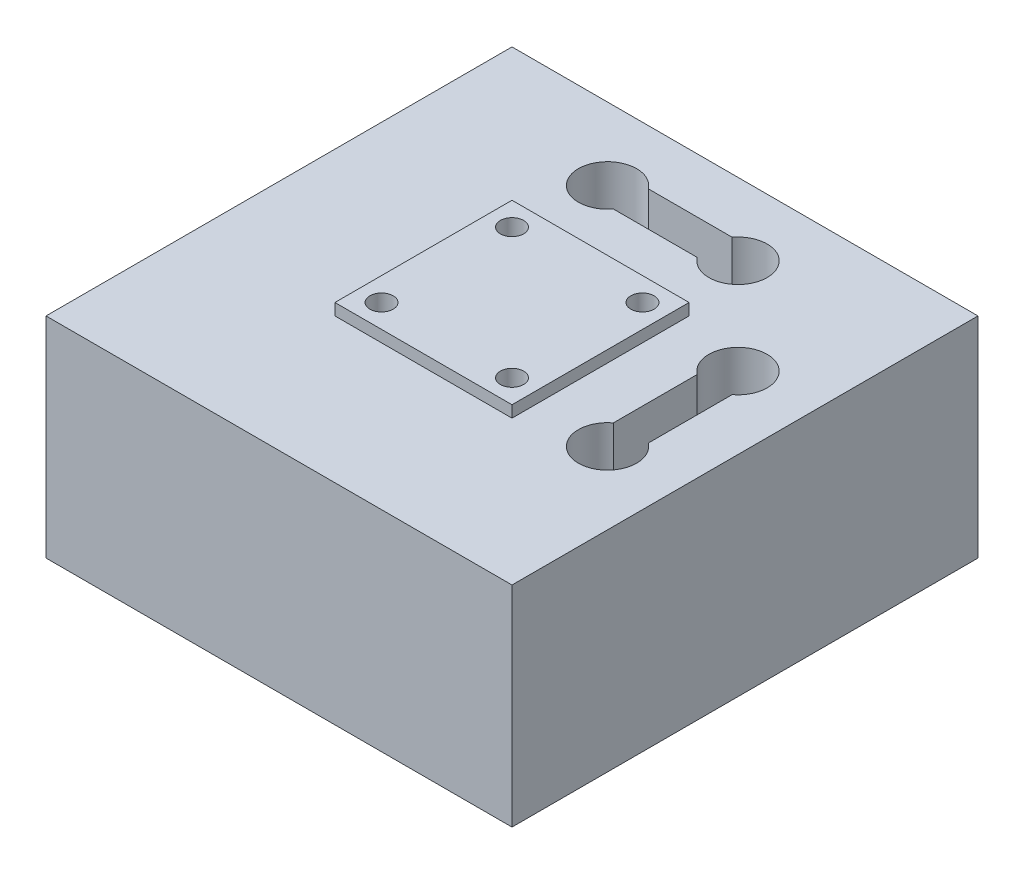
ISO-10303-21;
HEADER;
FILE_DESCRIPTION(('STEP AP214'),'2;1');
FILE_NAME('part.step','',(''),(''),'','','');
FILE_SCHEMA(('AUTOMOTIVE_DESIGN { 1 0 10303 214 1 1 1 1 }'));
ENDSEC;
DATA;
#1=APPLICATION_CONTEXT('core data for automotive mechanical design processes');
#2=APPLICATION_PROTOCOL_DEFINITION('international standard','automotive_design',2000,#1);
#3=PRODUCT_CONTEXT('',#1,'mechanical');
#4=PRODUCT('Part','Part','',(#3));
#5=PRODUCT_RELATED_PRODUCT_CATEGORY('part','',(#4));
#6=PRODUCT_DEFINITION_FORMATION('','',#4);
#7=PRODUCT_DEFINITION_CONTEXT('part definition',#1,'design');
#8=PRODUCT_DEFINITION('design','',#6,#7);
#9=PRODUCT_DEFINITION_SHAPE('','',#8);
#10=(LENGTH_UNIT() NAMED_UNIT(*) SI_UNIT(.MILLI.,.METRE.));
#11=(NAMED_UNIT(*) PLANE_ANGLE_UNIT() SI_UNIT($,.RADIAN.));
#12=(NAMED_UNIT(*) SI_UNIT($,.STERADIAN.) SOLID_ANGLE_UNIT());
#13=UNCERTAINTY_MEASURE_WITH_UNIT(LENGTH_MEASURE(1.E-05),#10,'distance_accuracy_value','');
#14=(GEOMETRIC_REPRESENTATION_CONTEXT(3) GLOBAL_UNCERTAINTY_ASSIGNED_CONTEXT((#13)) GLOBAL_UNIT_ASSIGNED_CONTEXT((#10,
#11,#12)) REPRESENTATION_CONTEXT('',''));
#15=CARTESIAN_POINT('',(0.,0.,0.));
#16=DIRECTION('',(0.,0.,1.));
#17=DIRECTION('',(1.,0.,0.));
#18=AXIS2_PLACEMENT_3D('',#15,#16,#17);
#19=CARTESIAN_POINT('',(0.,18.,0.));
#20=DIRECTION('',(1.,0.,0.));
#21=DIRECTION('',(0.,0.,-1.));
#22=AXIS2_PLACEMENT_3D('',#19,#20,#21);
#23=PLANE('',#22);
#24=DIRECTION('',(0.,0.,1.));
#25=VECTOR('',#24,1.);
#26=CARTESIAN_POINT('',(0.,0.,0.));
#27=LINE('',#26,#25);
#28=CARTESIAN_POINT('',(0.,0.,-40.));
#29=VERTEX_POINT('',#28);
#30=CARTESIAN_POINT('',(0.,0.,0.));
#31=VERTEX_POINT('',#30);
#32=EDGE_CURVE('E381',#29,#31,#27,.T.);
#33=ORIENTED_EDGE('',*,*,#32,.T.);
#34=DIRECTION('',(0.,-1.,0.));
#35=VECTOR('',#34,1.);
#36=CARTESIAN_POINT('',(0.,18.,0.));
#37=LINE('',#36,#35);
#38=CARTESIAN_POINT('',(0.,18.,0.));
#39=VERTEX_POINT('',#38);
#40=EDGE_CURVE('E419',#39,#31,#37,.T.);
#41=ORIENTED_EDGE('',*,*,#40,.F.);
#42=DIRECTION('',(0.,0.,1.));
#43=VECTOR('',#42,1.);
#44=CARTESIAN_POINT('',(0.,18.,0.));
#45=LINE('',#44,#43);
#46=CARTESIAN_POINT('',(0.,18.,-40.));
#47=VERTEX_POINT('',#46);
#48=EDGE_CURVE('E382',#47,#39,#45,.T.);
#49=ORIENTED_EDGE('',*,*,#48,.F.);
#50=DIRECTION('',(0.,-1.,0.));
#51=VECTOR('',#50,1.);
#52=CARTESIAN_POINT('',(0.,18.,-40.));
#53=LINE('',#52,#51);
#54=EDGE_CURVE('E396',#47,#29,#53,.T.);
#55=ORIENTED_EDGE('',*,*,#54,.T.);
#56=EDGE_LOOP('',(#33,#41,#49,#55));
#57=FACE_BOUND('',#56,.T.);
#58=ADVANCED_FACE('F45',(#57),#23,.F.);
#59=CARTESIAN_POINT('',(0.,18.,0.));
#60=DIRECTION('',(0.,0.,-1.));
#61=DIRECTION('',(-1.,0.,0.));
#62=AXIS2_PLACEMENT_3D('',#59,#60,#61);
#63=PLANE('',#62);
#64=DIRECTION('',(1.,0.,0.));
#65=VECTOR('',#64,1.);
#66=CARTESIAN_POINT('',(0.,0.,0.));
#67=LINE('',#66,#65);
#68=CARTESIAN_POINT('',(40.,0.,0.));
#69=VERTEX_POINT('',#68);
#70=EDGE_CURVE('E400',#31,#69,#67,.T.);
#71=ORIENTED_EDGE('',*,*,#70,.T.);
#72=DIRECTION('',(0.,-1.,0.));
#73=VECTOR('',#72,1.);
#74=CARTESIAN_POINT('',(40.,18.,0.));
#75=LINE('',#74,#73);
#76=CARTESIAN_POINT('',(40.,18.,0.));
#77=VERTEX_POINT('',#76);
#78=EDGE_CURVE('E415',#77,#69,#75,.T.);
#79=ORIENTED_EDGE('',*,*,#78,.F.);
#80=DIRECTION('',(1.,0.,0.));
#81=VECTOR('',#80,1.);
#82=CARTESIAN_POINT('',(0.,18.,0.));
#83=LINE('',#82,#81);
#84=EDGE_CURVE('E386',#39,#77,#83,.T.);
#85=ORIENTED_EDGE('',*,*,#84,.F.);
#86=ORIENTED_EDGE('',*,*,#40,.T.);
#87=EDGE_LOOP('',(#71,#79,#85,#86));
#88=FACE_BOUND('',#87,.T.);
#89=ADVANCED_FACE('F460',(#88),#63,.F.);
#90=CARTESIAN_POINT('',(40.,18.,0.));
#91=DIRECTION('',(-1.,0.,0.));
#92=DIRECTION('',(0.,0.,1.));
#93=AXIS2_PLACEMENT_3D('',#90,#91,#92);
#94=PLANE('',#93);
#95=DIRECTION('',(0.,0.,-1.));
#96=VECTOR('',#95,1.);
#97=CARTESIAN_POINT('',(40.,0.,0.));
#98=LINE('',#97,#96);
#99=CARTESIAN_POINT('',(40.,0.,-40.));
#100=VERTEX_POINT('',#99);
#101=EDGE_CURVE('E403',#69,#100,#98,.T.);
#102=ORIENTED_EDGE('',*,*,#101,.T.);
#103=DIRECTION('',(0.,-1.,0.));
#104=VECTOR('',#103,1.);
#105=CARTESIAN_POINT('',(40.,18.,-40.));
#106=LINE('',#105,#104);
#107=CARTESIAN_POINT('',(40.,18.,-40.));
#108=VERTEX_POINT('',#107);
#109=EDGE_CURVE('E411',#108,#100,#106,.T.);
#110=ORIENTED_EDGE('',*,*,#109,.F.);
#111=DIRECTION('',(0.,0.,-1.));
#112=VECTOR('',#111,1.);
#113=CARTESIAN_POINT('',(40.,18.,0.));
#114=LINE('',#113,#112);
#115=EDGE_CURVE('E390',#77,#108,#114,.T.);
#116=ORIENTED_EDGE('',*,*,#115,.F.);
#117=ORIENTED_EDGE('',*,*,#78,.T.);
#118=EDGE_LOOP('',(#102,#110,#116,#117));
#119=FACE_BOUND('',#118,.T.);
#120=ADVANCED_FACE('F465',(#119),#94,.F.);
#121=CARTESIAN_POINT('',(0.,18.,-40.));
#122=DIRECTION('',(0.,0.,1.));
#123=DIRECTION('',(1.,0.,0.));
#124=AXIS2_PLACEMENT_3D('',#121,#122,#123);
#125=PLANE('',#124);
#126=DIRECTION('',(-1.,0.,0.));
#127=VECTOR('',#126,1.);
#128=CARTESIAN_POINT('',(0.,0.,-40.));
#129=LINE('',#128,#127);
#130=EDGE_CURVE('E387',#100,#29,#129,.T.);
#131=ORIENTED_EDGE('',*,*,#130,.T.);
#132=ORIENTED_EDGE('',*,*,#54,.F.);
#133=DIRECTION('',(-1.,0.,0.));
#134=VECTOR('',#133,1.);
#135=CARTESIAN_POINT('',(0.,18.,-40.));
#136=LINE('',#135,#134);
#137=EDGE_CURVE('E393',#108,#47,#136,.T.);
#138=ORIENTED_EDGE('',*,*,#137,.F.);
#139=ORIENTED_EDGE('',*,*,#109,.T.);
#140=EDGE_LOOP('',(#131,#132,#138,#139));
#141=FACE_BOUND('',#140,.T.);
#142=ADVANCED_FACE('F448',(#141),#125,.F.);
#143=CARTESIAN_POINT('',(0.,18.,0.));
#144=DIRECTION('',(0.,-1.,0.));
#145=DIRECTION('',(0.,0.,-1.));
#146=AXIS2_PLACEMENT_3D('',#143,#144,#145);
#147=PLANE('',#146);
#148=DIRECTION('',(-1.,0.,0.));
#149=VECTOR('',#148,1.);
#150=CARTESIAN_POINT('',(0.,18.,-32.3));
#151=LINE('',#150,#149);
#152=CARTESIAN_POINT('',(23.6,18.,-32.3));
#153=VERTEX_POINT('',#152);
#154=CARTESIAN_POINT('',(16.4,18.,-32.3));
#155=VERTEX_POINT('',#154);
#156=EDGE_CURVE('E300',#153,#155,#151,.T.);
#157=ORIENTED_EDGE('',*,*,#156,.T.);
#158=CARTESIAN_POINT('',(14.4,18.,-33.8));
#159=DIRECTION('',(0.,-1.,0.));
#160=DIRECTION('',(0.,0.,-1.));
#161=AXIS2_PLACEMENT_3D('',#158,#159,#160);
#162=CIRCLE('',#161,2.5);
#163=CARTESIAN_POINT('',(16.4,18.,-35.3));
#164=VERTEX_POINT('',#163);
#165=EDGE_CURVE('E309',#155,#164,#162,.T.);
#166=ORIENTED_EDGE('',*,*,#165,.T.);
#167=DIRECTION('',(-1.,0.,0.));
#168=VECTOR('',#167,1.);
#169=CARTESIAN_POINT('',(0.,18.,-35.3));
#170=LINE('',#169,#168);
#171=CARTESIAN_POINT('',(23.6,18.,-35.3));
#172=VERTEX_POINT('',#171);
#173=EDGE_CURVE('E306',#172,#164,#170,.T.);
#174=ORIENTED_EDGE('',*,*,#173,.F.);
#175=CARTESIAN_POINT('',(25.6,18.,-33.8));
#176=DIRECTION('',(0.,-1.,0.));
#177=DIRECTION('',(0.,0.,-1.));
#178=AXIS2_PLACEMENT_3D('',#175,#176,#177);
#179=CIRCLE('',#178,2.5);
#180=EDGE_CURVE('E236',#172,#153,#179,.T.);
#181=ORIENTED_EDGE('',*,*,#180,.T.);
#182=EDGE_LOOP('',(#157,#166,#174,#181));
#183=FACE_BOUND('',#182,.T.);
#184=DIRECTION('',(0.,0.,-1.));
#185=VECTOR('',#184,1.);
#186=CARTESIAN_POINT('',(32.3,18.,0.));
#187=LINE('',#186,#185);
#188=CARTESIAN_POINT('',(32.3,18.,-16.4));
#189=VERTEX_POINT('',#188);
#190=CARTESIAN_POINT('',(32.3,18.,-23.6));
#191=VERTEX_POINT('',#190);
#192=EDGE_CURVE('E242',#189,#191,#187,.T.);
#193=ORIENTED_EDGE('',*,*,#192,.T.);
#194=CARTESIAN_POINT('',(33.8,18.,-25.6));
#195=DIRECTION('',(0.,-1.,0.));
#196=DIRECTION('',(0.,0.,-1.));
#197=AXIS2_PLACEMENT_3D('',#194,#195,#196);
#198=CIRCLE('',#197,2.5);
#199=CARTESIAN_POINT('',(35.3,18.,-23.6));
#200=VERTEX_POINT('',#199);
#201=EDGE_CURVE('E197',#191,#200,#198,.T.);
#202=ORIENTED_EDGE('',*,*,#201,.T.);
#203=DIRECTION('',(0.,0.,-1.));
#204=VECTOR('',#203,1.);
#205=CARTESIAN_POINT('',(35.3,18.,0.));
#206=LINE('',#205,#204);
#207=CARTESIAN_POINT('',(35.3,18.,-16.4));
#208=VERTEX_POINT('',#207);
#209=EDGE_CURVE('E295',#208,#200,#206,.T.);
#210=ORIENTED_EDGE('',*,*,#209,.F.);
#211=CARTESIAN_POINT('',(33.8,18.,-14.4));
#212=DIRECTION('',(0.,-1.,0.));
#213=DIRECTION('',(0.,0.,-1.));
#214=AXIS2_PLACEMENT_3D('',#211,#212,#213);
#215=CIRCLE('',#214,2.5);
#216=EDGE_CURVE('E291',#208,#189,#215,.T.);
#217=ORIENTED_EDGE('',*,*,#216,.T.);
#218=EDGE_LOOP('',(#193,#202,#210,#217));
#219=FACE_BOUND('',#218,.T.);
#220=DIRECTION('',(-1.,0.,0.));
#221=VECTOR('',#220,1.);
#222=CARTESIAN_POINT('',(0.,18.,-12.4));
#223=LINE('',#222,#221);
#224=CARTESIAN_POINT('',(27.6,18.,-12.4));
#225=VERTEX_POINT('',#224);
#226=CARTESIAN_POINT('',(12.4,18.,-12.4));
#227=VERTEX_POINT('',#226);
#228=EDGE_CURVE('E350',#225,#227,#223,.T.);
#229=ORIENTED_EDGE('',*,*,#228,.T.);
#230=DIRECTION('',(0.,0.,-1.));
#231=VECTOR('',#230,1.);
#232=CARTESIAN_POINT('',(12.4,18.,0.));
#233=LINE('',#232,#231);
#234=CARTESIAN_POINT('',(12.4,18.,-27.6));
#235=VERTEX_POINT('',#234);
#236=EDGE_CURVE('E377',#227,#235,#233,.T.);
#237=ORIENTED_EDGE('',*,*,#236,.T.);
#238=DIRECTION('',(1.,0.,0.));
#239=VECTOR('',#238,1.);
#240=CARTESIAN_POINT('',(0.,18.,-27.6));
#241=LINE('',#240,#239);
#242=CARTESIAN_POINT('',(27.6,18.,-27.6));
#243=VERTEX_POINT('',#242);
#244=EDGE_CURVE('E373',#235,#243,#241,.T.);
#245=ORIENTED_EDGE('',*,*,#244,.T.);
#246=DIRECTION('',(0.,0.,1.));
#247=VECTOR('',#246,1.);
#248=CARTESIAN_POINT('',(27.6,18.,0.));
#249=LINE('',#248,#247);
#250=EDGE_CURVE('E369',#243,#225,#249,.T.);
#251=ORIENTED_EDGE('',*,*,#250,.T.);
#252=EDGE_LOOP('',(#229,#237,#245,#251));
#253=FACE_BOUND('',#252,.T.);
#254=ORIENTED_EDGE('',*,*,#48,.T.);
#255=ORIENTED_EDGE('',*,*,#84,.T.);
#256=ORIENTED_EDGE('',*,*,#115,.T.);
#257=ORIENTED_EDGE('',*,*,#137,.T.);
#258=EDGE_LOOP('',(#254,#255,#256,#257));
#259=FACE_BOUND('',#258,.T.);
#260=ADVANCED_FACE('F445',(#183,#219,#253,#259),#147,.F.);
#261=CARTESIAN_POINT('',(0.,0.,0.));
#262=DIRECTION('',(0.,-1.,0.));
#263=DIRECTION('',(0.,0.,-1.));
#264=AXIS2_PLACEMENT_3D('',#261,#262,#263);
#265=PLANE('',#264);
#266=CARTESIAN_POINT('',(14.4,0.,-33.8));
#267=DIRECTION('',(0.,-1.,0.));
#268=DIRECTION('',(0.,0.,-1.));
#269=AXIS2_PLACEMENT_3D('',#266,#267,#268);
#270=CIRCLE('',#269,2.5);
#271=CARTESIAN_POINT('',(16.4,0.,-32.3));
#272=VERTEX_POINT('',#271);
#273=CARTESIAN_POINT('',(16.4,0.,-35.3));
#274=VERTEX_POINT('',#273);
#275=EDGE_CURVE('E11',#272,#274,#270,.T.);
#276=ORIENTED_EDGE('',*,*,#275,.F.);
#277=DIRECTION('',(-1.,0.,0.));
#278=VECTOR('',#277,1.);
#279=CARTESIAN_POINT('',(0.,0.,-32.3));
#280=LINE('',#279,#278);
#281=CARTESIAN_POINT('',(23.6,0.,-32.3));
#282=VERTEX_POINT('',#281);
#283=EDGE_CURVE('E206',#282,#272,#280,.T.);
#284=ORIENTED_EDGE('',*,*,#283,.F.);
#285=CARTESIAN_POINT('',(25.6,0.,-33.8));
#286=DIRECTION('',(0.,-1.,0.));
#287=DIRECTION('',(0.,0.,-1.));
#288=AXIS2_PLACEMENT_3D('',#285,#286,#287);
#289=CIRCLE('',#288,2.5);
#290=CARTESIAN_POINT('',(23.6,0.,-35.3));
#291=VERTEX_POINT('',#290);
#292=EDGE_CURVE('E210',#291,#282,#289,.T.);
#293=ORIENTED_EDGE('',*,*,#292,.F.);
#294=DIRECTION('',(-1.,0.,0.));
#295=VECTOR('',#294,1.);
#296=CARTESIAN_POINT('',(0.,0.,-35.3));
#297=LINE('',#296,#295);
#298=EDGE_CURVE('E53',#291,#274,#297,.T.);
#299=ORIENTED_EDGE('',*,*,#298,.T.);
#300=EDGE_LOOP('',(#276,#284,#293,#299));
#301=FACE_BOUND('',#300,.T.);
#302=CARTESIAN_POINT('',(33.8,0.,-25.6));
#303=DIRECTION('',(0.,-1.,0.));
#304=DIRECTION('',(0.,0.,-1.));
#305=AXIS2_PLACEMENT_3D('',#302,#303,#304);
#306=CIRCLE('',#305,2.5);
#307=CARTESIAN_POINT('',(32.3,0.,-23.6));
#308=VERTEX_POINT('',#307);
#309=CARTESIAN_POINT('',(35.3,0.,-23.6));
#310=VERTEX_POINT('',#309);
#311=EDGE_CURVE('E194',#308,#310,#306,.T.);
#312=ORIENTED_EDGE('',*,*,#311,.F.);
#313=DIRECTION('',(0.,0.,-1.));
#314=VECTOR('',#313,1.);
#315=CARTESIAN_POINT('',(32.3,0.,0.));
#316=LINE('',#315,#314);
#317=CARTESIAN_POINT('',(32.3,0.,-16.4));
#318=VERTEX_POINT('',#317);
#319=EDGE_CURVE('E179',#318,#308,#316,.T.);
#320=ORIENTED_EDGE('',*,*,#319,.F.);
#321=CARTESIAN_POINT('',(33.8,0.,-14.4));
#322=DIRECTION('',(0.,-1.,0.));
#323=DIRECTION('',(0.,0.,-1.));
#324=AXIS2_PLACEMENT_3D('',#321,#322,#323);
#325=CIRCLE('',#324,2.5);
#326=CARTESIAN_POINT('',(35.3,0.,-16.4));
#327=VERTEX_POINT('',#326);
#328=EDGE_CURVE('E188',#327,#318,#325,.T.);
#329=ORIENTED_EDGE('',*,*,#328,.F.);
#330=DIRECTION('',(0.,0.,-1.));
#331=VECTOR('',#330,1.);
#332=CARTESIAN_POINT('',(35.3,0.,0.));
#333=LINE('',#332,#331);
#334=EDGE_CURVE('E204',#327,#310,#333,.T.);
#335=ORIENTED_EDGE('',*,*,#334,.T.);
#336=EDGE_LOOP('',(#312,#320,#329,#335));
#337=FACE_BOUND('',#336,.T.);
#338=DIRECTION('',(0.,0.,-1.));
#339=VECTOR('',#338,1.);
#340=CARTESIAN_POINT('',(12.4,0.,0.));
#341=LINE('',#340,#339);
#342=CARTESIAN_POINT('',(12.4,0.,-12.4));
#343=VERTEX_POINT('',#342);
#344=CARTESIAN_POINT('',(12.4,0.,-27.6));
#345=VERTEX_POINT('',#344);
#346=EDGE_CURVE('E189',#343,#345,#341,.T.);
#347=ORIENTED_EDGE('',*,*,#346,.F.);
#348=DIRECTION('',(-1.,0.,0.));
#349=VECTOR('',#348,1.);
#350=CARTESIAN_POINT('',(0.,0.,-12.4));
#351=LINE('',#350,#349);
#352=CARTESIAN_POINT('',(27.6,0.,-12.4));
#353=VERTEX_POINT('',#352);
#354=EDGE_CURVE('E423',#353,#343,#351,.T.);
#355=ORIENTED_EDGE('',*,*,#354,.F.);
#356=DIRECTION('',(0.,0.,1.));
#357=VECTOR('',#356,1.);
#358=CARTESIAN_POINT('',(27.6,0.,0.));
#359=LINE('',#358,#357);
#360=CARTESIAN_POINT('',(27.6,0.,-27.6));
#361=VERTEX_POINT('',#360);
#362=EDGE_CURVE('E427',#361,#353,#359,.T.);
#363=ORIENTED_EDGE('',*,*,#362,.F.);
#364=DIRECTION('',(1.,0.,0.));
#365=VECTOR('',#364,1.);
#366=CARTESIAN_POINT('',(0.,0.,-27.6));
#367=LINE('',#366,#365);
#368=EDGE_CURVE('E431',#345,#361,#367,.T.);
#369=ORIENTED_EDGE('',*,*,#368,.F.);
#370=EDGE_LOOP('',(#347,#355,#363,#369));
#371=FACE_BOUND('',#370,.T.);
#372=ORIENTED_EDGE('',*,*,#32,.F.);
#373=ORIENTED_EDGE('',*,*,#130,.F.);
#374=ORIENTED_EDGE('',*,*,#101,.F.);
#375=ORIENTED_EDGE('',*,*,#70,.F.);
#376=EDGE_LOOP('',(#372,#373,#374,#375));
#377=FACE_BOUND('',#376,.T.);
#378=ADVANCED_FACE('F202',(#301,#337,#371,#377),#265,.T.);
#379=CARTESIAN_POINT('',(0.,-1.,0.));
#380=DIRECTION('',(0.,-1.,0.));
#381=DIRECTION('',(0.,0.,-1.));
#382=AXIS2_PLACEMENT_3D('',#379,#380,#381);
#383=PLANE('',#382);
#384=CARTESIAN_POINT('',(14.4,-1.,-14.4));
#385=DIRECTION('',(0.,1.,0.));
#386=DIRECTION('',(0.,0.,1.));
#387=AXIS2_PLACEMENT_3D('',#384,#385,#386);
#388=CIRCLE('',#387,1.);
#389=CARTESIAN_POINT('',(14.4,-1.,-13.4));
#390=VERTEX_POINT('',#389);
#391=EDGE_CURVE('E253',#390,#390,#388,.T.);
#392=ORIENTED_EDGE('',*,*,#391,.T.);
#393=EDGE_LOOP('',(#392));
#394=FACE_BOUND('',#393,.T.);
#395=CARTESIAN_POINT('',(25.6,-1.,-14.4));
#396=DIRECTION('',(0.,1.,0.));
#397=DIRECTION('',(0.,0.,1.));
#398=AXIS2_PLACEMENT_3D('',#395,#396,#397);
#399=CIRCLE('',#398,1.);
#400=CARTESIAN_POINT('',(25.6,-1.,-13.4));
#401=VERTEX_POINT('',#400);
#402=EDGE_CURVE('E261',#401,#401,#399,.T.);
#403=ORIENTED_EDGE('',*,*,#402,.T.);
#404=EDGE_LOOP('',(#403));
#405=FACE_BOUND('',#404,.T.);
#406=CARTESIAN_POINT('',(25.6,-1.,-25.6));
#407=DIRECTION('',(0.,1.,0.));
#408=DIRECTION('',(0.,0.,1.));
#409=AXIS2_PLACEMENT_3D('',#406,#407,#408);
#410=CIRCLE('',#409,1.);
#411=CARTESIAN_POINT('',(25.6,-1.,-24.6));
#412=VERTEX_POINT('',#411);
#413=EDGE_CURVE('E262',#412,#412,#410,.T.);
#414=ORIENTED_EDGE('',*,*,#413,.T.);
#415=EDGE_LOOP('',(#414));
#416=FACE_BOUND('',#415,.T.);
#417=CARTESIAN_POINT('',(14.4,-1.,-25.6));
#418=DIRECTION('',(0.,1.,0.));
#419=DIRECTION('',(0.,0.,1.));
#420=AXIS2_PLACEMENT_3D('',#417,#418,#419);
#421=CIRCLE('',#420,1.);
#422=CARTESIAN_POINT('',(14.4,-1.,-24.6));
#423=VERTEX_POINT('',#422);
#424=EDGE_CURVE('E252',#423,#423,#421,.T.);
#425=ORIENTED_EDGE('',*,*,#424,.T.);
#426=EDGE_LOOP('',(#425));
#427=FACE_BOUND('',#426,.T.);
#428=DIRECTION('',(0.,0.,1.));
#429=VECTOR('',#428,1.);
#430=CARTESIAN_POINT('',(12.4,-1.,-12.4));
#431=LINE('',#430,#429);
#432=CARTESIAN_POINT('',(12.4,-1.,-27.6));
#433=VERTEX_POINT('',#432);
#434=CARTESIAN_POINT('',(12.4,-1.,-12.4));
#435=VERTEX_POINT('',#434);
#436=EDGE_CURVE('E329',#433,#435,#431,.T.);
#437=ORIENTED_EDGE('',*,*,#436,.F.);
#438=DIRECTION('',(-1.,0.,0.));
#439=VECTOR('',#438,1.);
#440=CARTESIAN_POINT('',(12.4,-1.,-27.6));
#441=LINE('',#440,#439);
#442=CARTESIAN_POINT('',(27.6,-1.,-27.6));
#443=VERTEX_POINT('',#442);
#444=EDGE_CURVE('E341',#443,#433,#441,.T.);
#445=ORIENTED_EDGE('',*,*,#444,.F.);
#446=DIRECTION('',(0.,0.,-1.));
#447=VECTOR('',#446,1.);
#448=CARTESIAN_POINT('',(27.6,-1.,-12.4));
#449=LINE('',#448,#447);
#450=CARTESIAN_POINT('',(27.6,-1.,-12.4));
#451=VERTEX_POINT('',#450);
#452=EDGE_CURVE('E337',#451,#443,#449,.T.);
#453=ORIENTED_EDGE('',*,*,#452,.F.);
#454=DIRECTION('',(1.,0.,0.));
#455=VECTOR('',#454,1.);
#456=CARTESIAN_POINT('',(12.4,-1.,-12.4));
#457=LINE('',#456,#455);
#458=EDGE_CURVE('E333',#435,#451,#457,.T.);
#459=ORIENTED_EDGE('',*,*,#458,.F.);
#460=EDGE_LOOP('',(#437,#445,#453,#459));
#461=FACE_BOUND('',#460,.T.);
#462=ADVANCED_FACE('F470',(#394,#405,#416,#427,#461),#383,.T.);
#463=CARTESIAN_POINT('',(12.4,-1.,-12.4));
#464=DIRECTION('',(0.,0.,1.));
#465=DIRECTION('',(1.,0.,0.));
#466=AXIS2_PLACEMENT_3D('',#463,#464,#465);
#467=PLANE('',#466);
#468=DIRECTION('',(0.,1.,0.));
#469=VECTOR('',#468,1.);
#470=CARTESIAN_POINT('',(27.6,-1.,-12.4));
#471=LINE('',#470,#469);
#472=EDGE_CURVE('E357',#451,#353,#471,.T.);
#473=ORIENTED_EDGE('',*,*,#472,.T.);
#474=ORIENTED_EDGE('',*,*,#354,.T.);
#475=DIRECTION('',(0.,1.,0.));
#476=VECTOR('',#475,1.);
#477=CARTESIAN_POINT('',(12.4,-1.,-12.4));
#478=LINE('',#477,#476);
#479=EDGE_CURVE('E362',#435,#343,#478,.T.);
#480=ORIENTED_EDGE('',*,*,#479,.F.);
#481=ORIENTED_EDGE('',*,*,#458,.T.);
#482=EDGE_LOOP('',(#473,#474,#480,#481));
#483=FACE_BOUND('',#482,.T.);
#484=ADVANCED_FACE('F475',(#483),#467,.T.);
#485=CARTESIAN_POINT('',(27.6,-1.,-12.4));
#486=DIRECTION('',(1.,0.,0.));
#487=DIRECTION('',(0.,0.,-1.));
#488=AXIS2_PLACEMENT_3D('',#485,#486,#487);
#489=PLANE('',#488);
#490=DIRECTION('',(0.,1.,0.));
#491=VECTOR('',#490,1.);
#492=CARTESIAN_POINT('',(27.6,-1.,-27.6));
#493=LINE('',#492,#491);
#494=EDGE_CURVE('E352',#443,#361,#493,.T.);
#495=ORIENTED_EDGE('',*,*,#494,.T.);
#496=ORIENTED_EDGE('',*,*,#362,.T.);
#497=ORIENTED_EDGE('',*,*,#472,.F.);
#498=ORIENTED_EDGE('',*,*,#452,.T.);
#499=EDGE_LOOP('',(#495,#496,#497,#498));
#500=FACE_BOUND('',#499,.T.);
#501=ADVANCED_FACE('F500',(#500),#489,.T.);
#502=CARTESIAN_POINT('',(12.4,-1.,-27.6));
#503=DIRECTION('',(0.,0.,-1.));
#504=DIRECTION('',(-1.,0.,0.));
#505=AXIS2_PLACEMENT_3D('',#502,#503,#504);
#506=PLANE('',#505);
#507=DIRECTION('',(0.,1.,0.));
#508=VECTOR('',#507,1.);
#509=CARTESIAN_POINT('',(12.4,-1.,-27.6));
#510=LINE('',#509,#508);
#511=EDGE_CURVE('E346',#433,#345,#510,.T.);
#512=ORIENTED_EDGE('',*,*,#511,.T.);
#513=ORIENTED_EDGE('',*,*,#368,.T.);
#514=ORIENTED_EDGE('',*,*,#494,.F.);
#515=ORIENTED_EDGE('',*,*,#444,.T.);
#516=EDGE_LOOP('',(#512,#513,#514,#515));
#517=FACE_BOUND('',#516,.T.);
#518=ADVANCED_FACE('F511',(#517),#506,.T.);
#519=CARTESIAN_POINT('',(12.4,-1.,-12.4));
#520=DIRECTION('',(-1.,0.,0.));
#521=DIRECTION('',(0.,0.,1.));
#522=AXIS2_PLACEMENT_3D('',#519,#520,#521);
#523=PLANE('',#522);
#524=ORIENTED_EDGE('',*,*,#479,.T.);
#525=ORIENTED_EDGE('',*,*,#346,.T.);
#526=ORIENTED_EDGE('',*,*,#511,.F.);
#527=ORIENTED_EDGE('',*,*,#436,.T.);
#528=EDGE_LOOP('',(#524,#525,#526,#527));
#529=FACE_BOUND('',#528,.T.);
#530=ADVANCED_FACE('F521',(#529),#523,.T.);
#531=ORIENTED_EDGE('',*,*,#236,.F.);
#532=CARTESIAN_POINT('',(12.4,19.,-12.4));
#533=VERTEX_POINT('',#532);
#534=EDGE_CURVE('E345',#227,#533,#478,.T.);
#535=ORIENTED_EDGE('',*,*,#534,.T.);
#536=DIRECTION('',(0.,0.,1.));
#537=VECTOR('',#536,1.);
#538=CARTESIAN_POINT('',(12.4,19.,-12.4));
#539=LINE('',#538,#537);
#540=CARTESIAN_POINT('',(12.4,19.,-27.6));
#541=VERTEX_POINT('',#540);
#542=EDGE_CURVE('E313',#541,#533,#539,.T.);
#543=ORIENTED_EDGE('',*,*,#542,.F.);
#544=EDGE_CURVE('E351',#235,#541,#510,.T.);
#545=ORIENTED_EDGE('',*,*,#544,.F.);
#546=EDGE_LOOP('',(#531,#535,#543,#545));
#547=FACE_BOUND('',#546,.T.);
#548=ADVANCED_FACE('F531',(#547),#523,.T.);
#549=ORIENTED_EDGE('',*,*,#244,.F.);
#550=ORIENTED_EDGE('',*,*,#544,.T.);
#551=DIRECTION('',(-1.,0.,0.));
#552=VECTOR('',#551,1.);
#553=CARTESIAN_POINT('',(12.4,19.,-27.6));
#554=LINE('',#553,#552);
#555=CARTESIAN_POINT('',(27.6,19.,-27.6));
#556=VERTEX_POINT('',#555);
#557=EDGE_CURVE('E325',#556,#541,#554,.T.);
#558=ORIENTED_EDGE('',*,*,#557,.F.);
#559=EDGE_CURVE('E356',#243,#556,#493,.T.);
#560=ORIENTED_EDGE('',*,*,#559,.F.);
#561=EDGE_LOOP('',(#549,#550,#558,#560));
#562=FACE_BOUND('',#561,.T.);
#563=ADVANCED_FACE('F524',(#562),#506,.T.);
#564=ORIENTED_EDGE('',*,*,#250,.F.);
#565=ORIENTED_EDGE('',*,*,#559,.T.);
#566=DIRECTION('',(0.,0.,-1.));
#567=VECTOR('',#566,1.);
#568=CARTESIAN_POINT('',(27.6,19.,-12.4));
#569=LINE('',#568,#567);
#570=CARTESIAN_POINT('',(27.6,19.,-12.4));
#571=VERTEX_POINT('',#570);
#572=EDGE_CURVE('E321',#571,#556,#569,.T.);
#573=ORIENTED_EDGE('',*,*,#572,.F.);
#574=EDGE_CURVE('E361',#225,#571,#471,.T.);
#575=ORIENTED_EDGE('',*,*,#574,.F.);
#576=EDGE_LOOP('',(#564,#565,#573,#575));
#577=FACE_BOUND('',#576,.T.);
#578=ADVANCED_FACE('F514',(#577),#489,.T.);
#579=ORIENTED_EDGE('',*,*,#228,.F.);
#580=ORIENTED_EDGE('',*,*,#574,.T.);
#581=DIRECTION('',(1.,0.,0.));
#582=VECTOR('',#581,1.);
#583=CARTESIAN_POINT('',(12.4,19.,-12.4));
#584=LINE('',#583,#582);
#585=EDGE_CURVE('E317',#533,#571,#584,.T.);
#586=ORIENTED_EDGE('',*,*,#585,.F.);
#587=ORIENTED_EDGE('',*,*,#534,.F.);
#588=EDGE_LOOP('',(#579,#580,#586,#587));
#589=FACE_BOUND('',#588,.T.);
#590=ADVANCED_FACE('F503',(#589),#467,.T.);
#591=CARTESIAN_POINT('',(0.,19.,0.));
#592=DIRECTION('',(0.,-1.,0.));
#593=DIRECTION('',(0.,0.,-1.));
#594=AXIS2_PLACEMENT_3D('',#591,#592,#593);
#595=PLANE('',#594);
#596=CARTESIAN_POINT('',(14.4,19.,-14.4));
#597=DIRECTION('',(0.,1.,0.));
#598=DIRECTION('',(0.,0.,1.));
#599=AXIS2_PLACEMENT_3D('',#596,#597,#598);
#600=CIRCLE('',#599,1.);
#601=CARTESIAN_POINT('',(14.4,19.,-13.4));
#602=VERTEX_POINT('',#601);
#603=EDGE_CURVE('E248',#602,#602,#600,.T.);
#604=ORIENTED_EDGE('',*,*,#603,.F.);
#605=EDGE_LOOP('',(#604));
#606=FACE_BOUND('',#605,.T.);
#607=CARTESIAN_POINT('',(25.6,19.,-14.4));
#608=DIRECTION('',(0.,1.,0.));
#609=DIRECTION('',(0.,0.,1.));
#610=AXIS2_PLACEMENT_3D('',#607,#608,#609);
#611=CIRCLE('',#610,1.);
#612=CARTESIAN_POINT('',(25.6,19.,-13.4));
#613=VERTEX_POINT('',#612);
#614=EDGE_CURVE('E282',#613,#613,#611,.T.);
#615=ORIENTED_EDGE('',*,*,#614,.F.);
#616=EDGE_LOOP('',(#615));
#617=FACE_BOUND('',#616,.T.);
#618=CARTESIAN_POINT('',(25.6,19.,-25.6));
#619=DIRECTION('',(0.,1.,0.));
#620=DIRECTION('',(0.,0.,1.));
#621=AXIS2_PLACEMENT_3D('',#618,#619,#620);
#622=CIRCLE('',#621,1.);
#623=CARTESIAN_POINT('',(25.6,19.,-24.6));
#624=VERTEX_POINT('',#623);
#625=EDGE_CURVE('E257',#624,#624,#622,.T.);
#626=ORIENTED_EDGE('',*,*,#625,.F.);
#627=EDGE_LOOP('',(#626));
#628=FACE_BOUND('',#627,.T.);
#629=CARTESIAN_POINT('',(14.4,19.,-25.6));
#630=DIRECTION('',(0.,1.,0.));
#631=DIRECTION('',(0.,0.,1.));
#632=AXIS2_PLACEMENT_3D('',#629,#630,#631);
#633=CIRCLE('',#632,1.);
#634=CARTESIAN_POINT('',(14.4,19.,-24.6));
#635=VERTEX_POINT('',#634);
#636=EDGE_CURVE('E266',#635,#635,#633,.T.);
#637=ORIENTED_EDGE('',*,*,#636,.F.);
#638=EDGE_LOOP('',(#637));
#639=FACE_BOUND('',#638,.T.);
#640=ORIENTED_EDGE('',*,*,#542,.T.);
#641=ORIENTED_EDGE('',*,*,#585,.T.);
#642=ORIENTED_EDGE('',*,*,#572,.T.);
#643=ORIENTED_EDGE('',*,*,#557,.T.);
#644=EDGE_LOOP('',(#640,#641,#642,#643));
#645=FACE_BOUND('',#644,.T.);
#646=ADVANCED_FACE('F560',(#606,#617,#628,#639,#645),#595,.F.);
#647=CARTESIAN_POINT('',(14.4,-1.,-25.6));
#648=DIRECTION('',(0.,1.,0.));
#649=DIRECTION('',(0.,0.,1.));
#650=AXIS2_PLACEMENT_3D('',#647,#648,#649);
#651=CYLINDRICAL_SURFACE('',#650,1.);
#652=ORIENTED_EDGE('',*,*,#424,.F.);
#653=EDGE_LOOP('',(#652));
#654=FACE_BOUND('',#653,.T.);
#655=ORIENTED_EDGE('',*,*,#636,.T.);
#656=EDGE_LOOP('',(#655));
#657=FACE_BOUND('',#656,.T.);
#658=ADVANCED_FACE('F583',(#654,#657),#651,.F.);
#659=CARTESIAN_POINT('',(25.6,-1.,-25.6));
#660=DIRECTION('',(0.,1.,0.));
#661=DIRECTION('',(0.,0.,1.));
#662=AXIS2_PLACEMENT_3D('',#659,#660,#661);
#663=CYLINDRICAL_SURFACE('',#662,1.);
#664=ORIENTED_EDGE('',*,*,#413,.F.);
#665=EDGE_LOOP('',(#664));
#666=FACE_BOUND('',#665,.T.);
#667=ORIENTED_EDGE('',*,*,#625,.T.);
#668=EDGE_LOOP('',(#667));
#669=FACE_BOUND('',#668,.T.);
#670=ADVANCED_FACE('F592',(#666,#669),#663,.F.);
#671=CARTESIAN_POINT('',(25.6,-1.,-14.4));
#672=DIRECTION('',(0.,1.,0.));
#673=DIRECTION('',(0.,0.,1.));
#674=AXIS2_PLACEMENT_3D('',#671,#672,#673);
#675=CYLINDRICAL_SURFACE('',#674,1.);
#676=ORIENTED_EDGE('',*,*,#402,.F.);
#677=EDGE_LOOP('',(#676));
#678=FACE_BOUND('',#677,.T.);
#679=ORIENTED_EDGE('',*,*,#614,.T.);
#680=EDGE_LOOP('',(#679));
#681=FACE_BOUND('',#680,.T.);
#682=ADVANCED_FACE('F601',(#678,#681),#675,.F.);
#683=CARTESIAN_POINT('',(14.4,-1.,-14.4));
#684=DIRECTION('',(0.,1.,0.));
#685=DIRECTION('',(0.,0.,1.));
#686=AXIS2_PLACEMENT_3D('',#683,#684,#685);
#687=CYLINDRICAL_SURFACE('',#686,1.);
#688=ORIENTED_EDGE('',*,*,#391,.F.);
#689=EDGE_LOOP('',(#688));
#690=FACE_BOUND('',#689,.T.);
#691=ORIENTED_EDGE('',*,*,#603,.T.);
#692=EDGE_LOOP('',(#691));
#693=FACE_BOUND('',#692,.T.);
#694=ADVANCED_FACE('F610',(#690,#693),#687,.F.);
#695=CARTESIAN_POINT('',(33.8,-1.,-25.6));
#696=DIRECTION('',(0.,1.,0.));
#697=DIRECTION('',(0.,0.,1.));
#698=AXIS2_PLACEMENT_3D('',#695,#696,#697);
#699=CYLINDRICAL_SURFACE('',#698,2.5);
#700=DIRECTION('',(0.,1.,0.));
#701=VECTOR('',#700,1.);
#702=CARTESIAN_POINT('',(32.3,-1.,-23.6));
#703=LINE('',#702,#701);
#704=EDGE_CURVE('E68',#308,#191,#703,.T.);
#705=ORIENTED_EDGE('',*,*,#704,.F.);
#706=ORIENTED_EDGE('',*,*,#311,.T.);
#707=DIRECTION('',(0.,1.,0.));
#708=VECTOR('',#707,1.);
#709=CARTESIAN_POINT('',(35.3,-1.,-23.6));
#710=LINE('',#709,#708);
#711=EDGE_CURVE('E279',#310,#200,#710,.T.);
#712=ORIENTED_EDGE('',*,*,#711,.T.);
#713=ORIENTED_EDGE('',*,*,#201,.F.);
#714=EDGE_LOOP('',(#705,#706,#712,#713));
#715=FACE_BOUND('',#714,.T.);
#716=ADVANCED_FACE('F192',(#715),#699,.F.);
#717=CARTESIAN_POINT('',(35.3,-1.,0.));
#718=DIRECTION('',(-1.,0.,0.));
#719=DIRECTION('',(0.,0.,1.));
#720=AXIS2_PLACEMENT_3D('',#717,#718,#719);
#721=PLANE('',#720);
#722=ORIENTED_EDGE('',*,*,#209,.T.);
#723=ORIENTED_EDGE('',*,*,#711,.F.);
#724=ORIENTED_EDGE('',*,*,#334,.F.);
#725=DIRECTION('',(0.,1.,0.));
#726=VECTOR('',#725,1.);
#727=CARTESIAN_POINT('',(35.3,-1.,-16.4));
#728=LINE('',#727,#726);
#729=EDGE_CURVE('E275',#327,#208,#728,.T.);
#730=ORIENTED_EDGE('',*,*,#729,.T.);
#731=EDGE_LOOP('',(#722,#723,#724,#730));
#732=FACE_BOUND('',#731,.T.);
#733=ADVANCED_FACE('F443',(#732),#721,.T.);
#734=CARTESIAN_POINT('',(33.8,-1.,-14.4));
#735=DIRECTION('',(0.,1.,0.));
#736=DIRECTION('',(0.,0.,1.));
#737=AXIS2_PLACEMENT_3D('',#734,#735,#736);
#738=CYLINDRICAL_SURFACE('',#737,2.5);
#739=ORIENTED_EDGE('',*,*,#729,.F.);
#740=ORIENTED_EDGE('',*,*,#328,.T.);
#741=DIRECTION('',(0.,1.,0.));
#742=VECTOR('',#741,1.);
#743=CARTESIAN_POINT('',(32.3,-1.,-16.4));
#744=LINE('',#743,#742);
#745=EDGE_CURVE('E182',#318,#189,#744,.T.);
#746=ORIENTED_EDGE('',*,*,#745,.T.);
#747=ORIENTED_EDGE('',*,*,#216,.F.);
#748=EDGE_LOOP('',(#739,#740,#746,#747));
#749=FACE_BOUND('',#748,.T.);
#750=ADVANCED_FACE('F440',(#749),#738,.F.);
#751=CARTESIAN_POINT('',(32.3,-1.,0.));
#752=DIRECTION('',(-1.,0.,0.));
#753=DIRECTION('',(0.,0.,1.));
#754=AXIS2_PLACEMENT_3D('',#751,#752,#753);
#755=PLANE('',#754);
#756=ORIENTED_EDGE('',*,*,#745,.F.);
#757=ORIENTED_EDGE('',*,*,#319,.T.);
#758=ORIENTED_EDGE('',*,*,#704,.T.);
#759=ORIENTED_EDGE('',*,*,#192,.F.);
#760=EDGE_LOOP('',(#756,#757,#758,#759));
#761=FACE_BOUND('',#760,.T.);
#762=ADVANCED_FACE('F180',(#761),#755,.F.);
#763=CARTESIAN_POINT('',(14.4,-1.,-33.8));
#764=DIRECTION('',(0.,1.,0.));
#765=DIRECTION('',(0.,0.,1.));
#766=AXIS2_PLACEMENT_3D('',#763,#764,#765);
#767=CYLINDRICAL_SURFACE('',#766,2.5);
#768=DIRECTION('',(0.,1.,0.));
#769=VECTOR('',#768,1.);
#770=CARTESIAN_POINT('',(16.4,-1.,-32.3));
#771=LINE('',#770,#769);
#772=EDGE_CURVE('E60',#272,#155,#771,.T.);
#773=ORIENTED_EDGE('',*,*,#772,.F.);
#774=ORIENTED_EDGE('',*,*,#275,.T.);
#775=DIRECTION('',(0.,1.,0.));
#776=VECTOR('',#775,1.);
#777=CARTESIAN_POINT('',(16.4,-1.,-35.3));
#778=LINE('',#777,#776);
#779=EDGE_CURVE('E231',#274,#164,#778,.T.);
#780=ORIENTED_EDGE('',*,*,#779,.T.);
#781=ORIENTED_EDGE('',*,*,#165,.F.);
#782=EDGE_LOOP('',(#773,#774,#780,#781));
#783=FACE_BOUND('',#782,.T.);
#784=ADVANCED_FACE('F648',(#783),#767,.F.);
#785=CARTESIAN_POINT('',(0.,-1.,-35.3));
#786=DIRECTION('',(0.,0.,1.));
#787=DIRECTION('',(1.,0.,0.));
#788=AXIS2_PLACEMENT_3D('',#785,#786,#787);
#789=PLANE('',#788);
#790=ORIENTED_EDGE('',*,*,#173,.T.);
#791=ORIENTED_EDGE('',*,*,#779,.F.);
#792=ORIENTED_EDGE('',*,*,#298,.F.);
#793=DIRECTION('',(0.,1.,0.));
#794=VECTOR('',#793,1.);
#795=CARTESIAN_POINT('',(23.6,-1.,-35.3));
#796=LINE('',#795,#794);
#797=EDGE_CURVE('E228',#291,#172,#796,.T.);
#798=ORIENTED_EDGE('',*,*,#797,.T.);
#799=EDGE_LOOP('',(#790,#791,#792,#798));
#800=FACE_BOUND('',#799,.T.);
#801=ADVANCED_FACE('F227',(#800),#789,.T.);
#802=CARTESIAN_POINT('',(25.6,-1.,-33.8));
#803=DIRECTION('',(0.,1.,0.));
#804=DIRECTION('',(0.,0.,1.));
#805=AXIS2_PLACEMENT_3D('',#802,#803,#804);
#806=CYLINDRICAL_SURFACE('',#805,2.5);
#807=ORIENTED_EDGE('',*,*,#797,.F.);
#808=ORIENTED_EDGE('',*,*,#292,.T.);
#809=DIRECTION('',(0.,1.,0.));
#810=VECTOR('',#809,1.);
#811=CARTESIAN_POINT('',(23.6,-1.,-32.3));
#812=LINE('',#811,#810);
#813=EDGE_CURVE('E238',#282,#153,#812,.T.);
#814=ORIENTED_EDGE('',*,*,#813,.T.);
#815=ORIENTED_EDGE('',*,*,#180,.F.);
#816=EDGE_LOOP('',(#807,#808,#814,#815));
#817=FACE_BOUND('',#816,.T.);
#818=ADVANCED_FACE('F233',(#817),#806,.F.);
#819=CARTESIAN_POINT('',(0.,-1.,-32.3));
#820=DIRECTION('',(0.,0.,1.));
#821=DIRECTION('',(1.,0.,0.));
#822=AXIS2_PLACEMENT_3D('',#819,#820,#821);
#823=PLANE('',#822);
#824=ORIENTED_EDGE('',*,*,#813,.F.);
#825=ORIENTED_EDGE('',*,*,#283,.T.);
#826=ORIENTED_EDGE('',*,*,#772,.T.);
#827=ORIENTED_EDGE('',*,*,#156,.F.);
#828=EDGE_LOOP('',(#824,#825,#826,#827));
#829=FACE_BOUND('',#828,.T.);
#830=ADVANCED_FACE('F671',(#829),#823,.F.);
#831=CLOSED_SHELL('',(#58,#89,#120,#142,#260,#378,#462,#484,#501,#518,#530,#548,#563,#578,#590,
#646,#658,#670,#682,#694,#716,#733,#750,#762,#784,#801,#818,#830));
#832=MANIFOLD_SOLID_BREP('B2',#831);
#833=ADVANCED_BREP_SHAPE_REPRESENTATION('',(#18,#832),#14);
#834=SHAPE_DEFINITION_REPRESENTATION(#9,#833);
ENDSEC;
END-ISO-10303-21;
